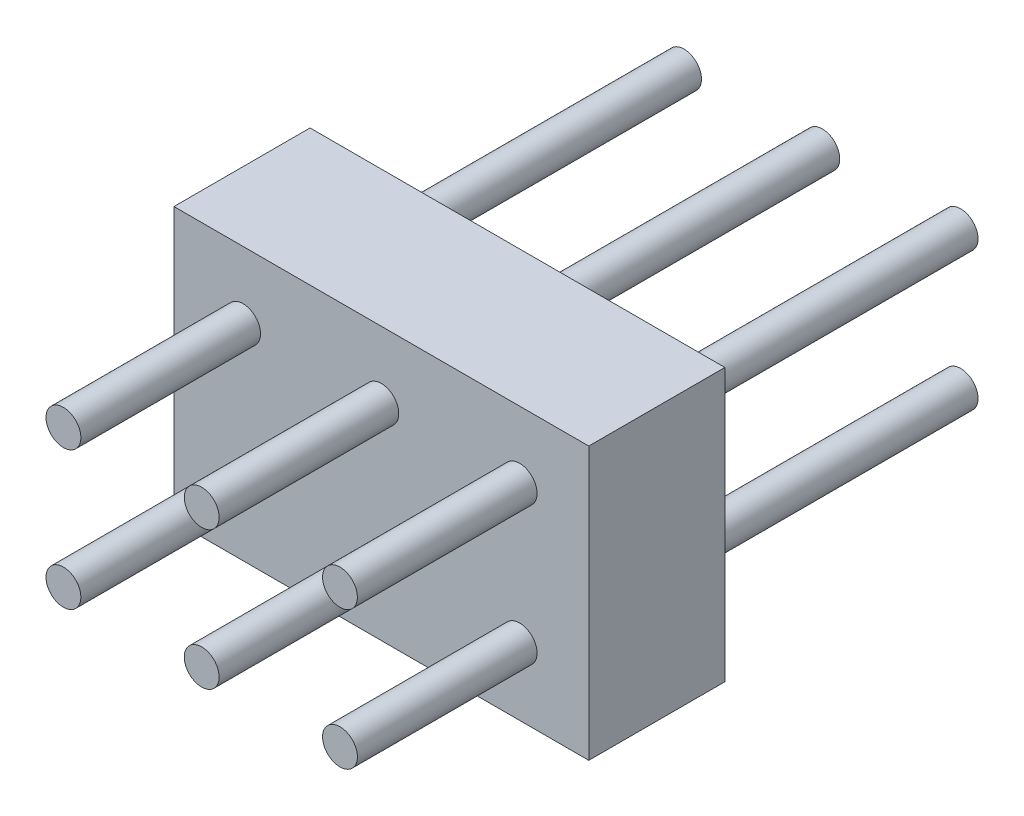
ISO-10303-21;
HEADER;
FILE_DESCRIPTION(('STEP AP214'),'2;1');
FILE_NAME('part.step','',(''),(''),'','','');
FILE_SCHEMA(('AUTOMOTIVE_DESIGN { 1 0 10303 214 1 1 1 1 }'));
ENDSEC;
DATA;
#1=APPLICATION_CONTEXT('core data for automotive mechanical design processes');
#2=APPLICATION_PROTOCOL_DEFINITION('international standard','automotive_design',2000,#1);
#3=PRODUCT_CONTEXT('',#1,'mechanical');
#4=PRODUCT('Part','Part','',(#3));
#5=PRODUCT_RELATED_PRODUCT_CATEGORY('part','',(#4));
#6=PRODUCT_DEFINITION_FORMATION('','',#4);
#7=PRODUCT_DEFINITION_CONTEXT('part definition',#1,'design');
#8=PRODUCT_DEFINITION('design','',#6,#7);
#9=PRODUCT_DEFINITION_SHAPE('','',#8);
#10=(LENGTH_UNIT() NAMED_UNIT(*) SI_UNIT(.MILLI.,.METRE.));
#11=(NAMED_UNIT(*) PLANE_ANGLE_UNIT() SI_UNIT($,.RADIAN.));
#12=(NAMED_UNIT(*) SI_UNIT($,.STERADIAN.) SOLID_ANGLE_UNIT());
#13=UNCERTAINTY_MEASURE_WITH_UNIT(LENGTH_MEASURE(1.E-05),#10,'distance_accuracy_value','');
#14=(GEOMETRIC_REPRESENTATION_CONTEXT(3) GLOBAL_UNCERTAINTY_ASSIGNED_CONTEXT((#13)) GLOBAL_UNIT_ASSIGNED_CONTEXT((#10,
#11,#12)) REPRESENTATION_CONTEXT('',''));
#15=CARTESIAN_POINT('',(0.,0.,0.));
#16=DIRECTION('',(0.,0.,1.));
#17=DIRECTION('',(1.,0.,0.));
#18=AXIS2_PLACEMENT_3D('',#15,#16,#17);
#19=CARTESIAN_POINT('',(0.,0.,2.5));
#20=DIRECTION('',(1.,0.,0.));
#21=DIRECTION('',(0.,0.,-1.));
#22=AXIS2_PLACEMENT_3D('',#19,#20,#21);
#23=PLANE('',#22);
#24=DIRECTION('',(0.,-1.,0.));
#25=VECTOR('',#24,1.);
#26=CARTESIAN_POINT('',(0.,0.,0.));
#27=LINE('',#26,#25);
#28=CARTESIAN_POINT('',(0.,5.,0.));
#29=VERTEX_POINT('',#28);
#30=CARTESIAN_POINT('',(0.,0.,0.));
#31=VERTEX_POINT('',#30);
#32=EDGE_CURVE('E102',#29,#31,#27,.T.);
#33=ORIENTED_EDGE('',*,*,#32,.T.);
#34=DIRECTION('',(0.,0.,-1.));
#35=VECTOR('',#34,1.);
#36=CARTESIAN_POINT('',(0.,0.,2.5));
#37=LINE('',#36,#35);
#38=CARTESIAN_POINT('',(0.,0.,2.5));
#39=VERTEX_POINT('',#38);
#40=EDGE_CURVE('E93',#39,#31,#37,.T.);
#41=ORIENTED_EDGE('',*,*,#40,.F.);
#42=DIRECTION('',(0.,-1.,0.));
#43=VECTOR('',#42,1.);
#44=CARTESIAN_POINT('',(0.,0.,2.5));
#45=LINE('',#44,#43);
#46=CARTESIAN_POINT('',(0.,5.,2.5));
#47=VERTEX_POINT('',#46);
#48=EDGE_CURVE('E87',#47,#39,#45,.T.);
#49=ORIENTED_EDGE('',*,*,#48,.F.);
#50=DIRECTION('',(0.,0.,-1.));
#51=VECTOR('',#50,1.);
#52=CARTESIAN_POINT('',(0.,5.,2.5));
#53=LINE('',#52,#51);
#54=EDGE_CURVE('E98',#47,#29,#53,.T.);
#55=ORIENTED_EDGE('',*,*,#54,.T.);
#56=EDGE_LOOP('',(#33,#41,#49,#55));
#57=FACE_BOUND('',#56,.T.);
#58=ADVANCED_FACE('F35',(#57),#23,.F.);
#59=CARTESIAN_POINT('',(0.,0.,2.5));
#60=DIRECTION('',(0.,1.,0.));
#61=DIRECTION('',(0.,0.,1.));
#62=AXIS2_PLACEMENT_3D('',#59,#60,#61);
#63=PLANE('',#62);
#64=DIRECTION('',(1.,0.,0.));
#65=VECTOR('',#64,1.);
#66=CARTESIAN_POINT('',(0.,0.,0.));
#67=LINE('',#66,#65);
#68=CARTESIAN_POINT('',(7.62,0.,0.));
#69=VERTEX_POINT('',#68);
#70=EDGE_CURVE('E92',#31,#69,#67,.T.);
#71=ORIENTED_EDGE('',*,*,#70,.T.);
#72=DIRECTION('',(0.,0.,-1.));
#73=VECTOR('',#72,1.);
#74=CARTESIAN_POINT('',(7.62,0.,2.5));
#75=LINE('',#74,#73);
#76=CARTESIAN_POINT('',(7.62,0.,2.5));
#77=VERTEX_POINT('',#76);
#78=EDGE_CURVE('E90',#77,#69,#75,.T.);
#79=ORIENTED_EDGE('',*,*,#78,.F.);
#80=DIRECTION('',(1.,0.,0.));
#81=VECTOR('',#80,1.);
#82=CARTESIAN_POINT('',(0.,0.,2.5));
#83=LINE('',#82,#81);
#84=EDGE_CURVE('E82',#39,#77,#83,.T.);
#85=ORIENTED_EDGE('',*,*,#84,.F.);
#86=ORIENTED_EDGE('',*,*,#40,.T.);
#87=EDGE_LOOP('',(#71,#79,#85,#86));
#88=FACE_BOUND('',#87,.T.);
#89=ADVANCED_FACE('F91',(#88),#63,.F.);
#90=CARTESIAN_POINT('',(7.62,0.,2.5));
#91=DIRECTION('',(-1.,0.,0.));
#92=DIRECTION('',(0.,0.,1.));
#93=AXIS2_PLACEMENT_3D('',#90,#91,#92);
#94=PLANE('',#93);
#95=DIRECTION('',(0.,1.,0.));
#96=VECTOR('',#95,1.);
#97=CARTESIAN_POINT('',(7.62,0.,0.));
#98=LINE('',#97,#96);
#99=CARTESIAN_POINT('',(7.62,5.,0.));
#100=VERTEX_POINT('',#99);
#101=EDGE_CURVE('E68',#69,#100,#98,.T.);
#102=ORIENTED_EDGE('',*,*,#101,.T.);
#103=DIRECTION('',(0.,0.,-1.));
#104=VECTOR('',#103,1.);
#105=CARTESIAN_POINT('',(7.62,5.,2.5));
#106=LINE('',#105,#104);
#107=CARTESIAN_POINT('',(7.62,5.,2.5));
#108=VERTEX_POINT('',#107);
#109=EDGE_CURVE('E94',#108,#100,#106,.T.);
#110=ORIENTED_EDGE('',*,*,#109,.F.);
#111=DIRECTION('',(0.,1.,0.));
#112=VECTOR('',#111,1.);
#113=CARTESIAN_POINT('',(7.62,0.,2.5));
#114=LINE('',#113,#112);
#115=EDGE_CURVE('E85',#77,#108,#114,.T.);
#116=ORIENTED_EDGE('',*,*,#115,.F.);
#117=ORIENTED_EDGE('',*,*,#78,.T.);
#118=EDGE_LOOP('',(#102,#110,#116,#117));
#119=FACE_BOUND('',#118,.T.);
#120=ADVANCED_FACE('F96',(#119),#94,.F.);
#121=CARTESIAN_POINT('',(0.,5.,2.5));
#122=DIRECTION('',(0.,-1.,0.));
#123=DIRECTION('',(0.,0.,-1.));
#124=AXIS2_PLACEMENT_3D('',#121,#122,#123);
#125=PLANE('',#124);
#126=DIRECTION('',(-1.,0.,0.));
#127=VECTOR('',#126,1.);
#128=CARTESIAN_POINT('',(0.,5.,0.));
#129=LINE('',#128,#127);
#130=EDGE_CURVE('E74',#100,#29,#129,.T.);
#131=ORIENTED_EDGE('',*,*,#130,.T.);
#132=ORIENTED_EDGE('',*,*,#54,.F.);
#133=DIRECTION('',(-1.,0.,0.));
#134=VECTOR('',#133,1.);
#135=CARTESIAN_POINT('',(0.,5.,2.5));
#136=LINE('',#135,#134);
#137=EDGE_CURVE('E51',#108,#47,#136,.T.);
#138=ORIENTED_EDGE('',*,*,#137,.F.);
#139=ORIENTED_EDGE('',*,*,#109,.T.);
#140=EDGE_LOOP('',(#131,#132,#138,#139));
#141=FACE_BOUND('',#140,.T.);
#142=ADVANCED_FACE('F122',(#141),#125,.F.);
#143=CARTESIAN_POINT('',(0.,0.,2.5));
#144=DIRECTION('',(0.,0.,-1.));
#145=DIRECTION('',(-1.,0.,0.));
#146=AXIS2_PLACEMENT_3D('',#143,#144,#145);
#147=PLANE('',#146);
#148=CARTESIAN_POINT('',(3.81,3.77,2.5));
#149=DIRECTION('',(0.,0.,-1.));
#150=DIRECTION('',(-1.,0.,0.));
#151=AXIS2_PLACEMENT_3D('',#148,#149,#150);
#152=CIRCLE('',#151,0.32);
#153=CARTESIAN_POINT('',(3.49,3.77,2.5));
#154=VERTEX_POINT('',#153);
#155=EDGE_CURVE('E452',#154,#154,#152,.T.);
#156=ORIENTED_EDGE('',*,*,#155,.T.);
#157=EDGE_LOOP('',(#156));
#158=FACE_BOUND('',#157,.T.);
#159=CARTESIAN_POINT('',(6.35,3.77,2.5));
#160=DIRECTION('',(0.,0.,-1.));
#161=DIRECTION('',(-1.,0.,0.));
#162=AXIS2_PLACEMENT_3D('',#159,#160,#161);
#163=CIRCLE('',#162,0.32);
#164=CARTESIAN_POINT('',(6.03,3.77,2.5));
#165=VERTEX_POINT('',#164);
#166=EDGE_CURVE('E458',#165,#165,#163,.T.);
#167=ORIENTED_EDGE('',*,*,#166,.T.);
#168=EDGE_LOOP('',(#167));
#169=FACE_BOUND('',#168,.T.);
#170=CARTESIAN_POINT('',(6.35,1.23,2.5));
#171=DIRECTION('',(0.,0.,-1.));
#172=DIRECTION('',(-1.,0.,0.));
#173=AXIS2_PLACEMENT_3D('',#170,#171,#172);
#174=CIRCLE('',#173,0.32);
#175=CARTESIAN_POINT('',(6.03,1.23,2.5));
#176=VERTEX_POINT('',#175);
#177=EDGE_CURVE('E11',#176,#176,#174,.F.);
#178=ORIENTED_EDGE('',*,*,#177,.F.);
#179=EDGE_LOOP('',(#178));
#180=FACE_BOUND('',#179,.T.);
#181=CARTESIAN_POINT('',(1.27,3.77,2.5));
#182=DIRECTION('',(0.,0.,-1.));
#183=DIRECTION('',(-1.,0.,0.));
#184=AXIS2_PLACEMENT_3D('',#181,#182,#183);
#185=CIRCLE('',#184,0.32);
#186=CARTESIAN_POINT('',(0.950000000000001,3.77,2.5));
#187=VERTEX_POINT('',#186);
#188=EDGE_CURVE('E467',#187,#187,#185,.T.);
#189=ORIENTED_EDGE('',*,*,#188,.T.);
#190=EDGE_LOOP('',(#189));
#191=FACE_BOUND('',#190,.T.);
#192=CARTESIAN_POINT('',(3.81,1.23,2.5));
#193=DIRECTION('',(0.,0.,-1.));
#194=DIRECTION('',(-1.,0.,0.));
#195=AXIS2_PLACEMENT_3D('',#192,#193,#194);
#196=CIRCLE('',#195,0.32);
#197=CARTESIAN_POINT('',(3.49,1.23,2.5));
#198=VERTEX_POINT('',#197);
#199=EDGE_CURVE('E43',#198,#198,#196,.F.);
#200=ORIENTED_EDGE('',*,*,#199,.F.);
#201=EDGE_LOOP('',(#200));
#202=FACE_BOUND('',#201,.T.);
#203=CARTESIAN_POINT('',(1.27,1.23,2.5));
#204=DIRECTION('',(0.,0.,-1.));
#205=DIRECTION('',(-1.,0.,0.));
#206=AXIS2_PLACEMENT_3D('',#203,#204,#205);
#207=CIRCLE('',#206,0.32);
#208=CARTESIAN_POINT('',(0.950000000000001,1.23,2.5));
#209=VERTEX_POINT('',#208);
#210=EDGE_CURVE('E112',#209,#209,#207,.F.);
#211=ORIENTED_EDGE('',*,*,#210,.F.);
#212=EDGE_LOOP('',(#211));
#213=FACE_BOUND('',#212,.T.);
#214=ORIENTED_EDGE('',*,*,#48,.T.);
#215=ORIENTED_EDGE('',*,*,#84,.T.);
#216=ORIENTED_EDGE('',*,*,#115,.T.);
#217=ORIENTED_EDGE('',*,*,#137,.T.);
#218=EDGE_LOOP('',(#214,#215,#216,#217));
#219=FACE_BOUND('',#218,.T.);
#220=ADVANCED_FACE('F83',(#158,#169,#180,#191,#202,#213,#219),#147,.F.);
#221=CARTESIAN_POINT('',(0.,0.,0.));
#222=DIRECTION('',(0.,0.,-1.));
#223=DIRECTION('',(-1.,0.,0.));
#224=AXIS2_PLACEMENT_3D('',#221,#222,#223);
#225=PLANE('',#224);
#226=CARTESIAN_POINT('',(6.35,3.77,0.));
#227=DIRECTION('',(0.,0.,-1.));
#228=DIRECTION('',(-1.,0.,0.));
#229=AXIS2_PLACEMENT_3D('',#226,#227,#228);
#230=CIRCLE('',#229,0.32);
#231=CARTESIAN_POINT('',(6.03,3.77,0.));
#232=VERTEX_POINT('',#231);
#233=EDGE_CURVE('E417',#232,#232,#230,.T.);
#234=ORIENTED_EDGE('',*,*,#233,.F.);
#235=EDGE_LOOP('',(#234));
#236=FACE_BOUND('',#235,.T.);
#237=CARTESIAN_POINT('',(6.35,1.23,0.));
#238=DIRECTION('',(0.,0.,-1.));
#239=DIRECTION('',(-1.,0.,0.));
#240=AXIS2_PLACEMENT_3D('',#237,#238,#239);
#241=CIRCLE('',#240,0.32);
#242=CARTESIAN_POINT('',(6.03,1.23,0.));
#243=VERTEX_POINT('',#242);
#244=EDGE_CURVE('E416',#243,#243,#241,.T.);
#245=ORIENTED_EDGE('',*,*,#244,.F.);
#246=EDGE_LOOP('',(#245));
#247=FACE_BOUND('',#246,.T.);
#248=CARTESIAN_POINT('',(3.81,3.77,0.));
#249=DIRECTION('',(0.,0.,-1.));
#250=DIRECTION('',(-1.,0.,0.));
#251=AXIS2_PLACEMENT_3D('',#248,#249,#250);
#252=CIRCLE('',#251,0.32);
#253=CARTESIAN_POINT('',(3.49,3.77,0.));
#254=VERTEX_POINT('',#253);
#255=EDGE_CURVE('E426',#254,#254,#252,.T.);
#256=ORIENTED_EDGE('',*,*,#255,.F.);
#257=EDGE_LOOP('',(#256));
#258=FACE_BOUND('',#257,.T.);
#259=CARTESIAN_POINT('',(3.81,1.23,0.));
#260=DIRECTION('',(0.,0.,-1.));
#261=DIRECTION('',(-1.,0.,0.));
#262=AXIS2_PLACEMENT_3D('',#259,#260,#261);
#263=CIRCLE('',#262,0.32);
#264=CARTESIAN_POINT('',(3.49,1.23,0.));
#265=VERTEX_POINT('',#264);
#266=EDGE_CURVE('E431',#265,#265,#263,.T.);
#267=ORIENTED_EDGE('',*,*,#266,.F.);
#268=EDGE_LOOP('',(#267));
#269=FACE_BOUND('',#268,.T.);
#270=CARTESIAN_POINT('',(1.27,3.77,0.));
#271=DIRECTION('',(0.,0.,-1.));
#272=DIRECTION('',(-1.,0.,0.));
#273=AXIS2_PLACEMENT_3D('',#270,#271,#272);
#274=CIRCLE('',#273,0.32);
#275=CARTESIAN_POINT('',(0.950000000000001,3.77,0.));
#276=VERTEX_POINT('',#275);
#277=EDGE_CURVE('E437',#276,#276,#274,.T.);
#278=ORIENTED_EDGE('',*,*,#277,.F.);
#279=EDGE_LOOP('',(#278));
#280=FACE_BOUND('',#279,.T.);
#281=CARTESIAN_POINT('',(1.27,1.23,0.));
#282=DIRECTION('',(0.,0.,-1.));
#283=DIRECTION('',(-1.,0.,0.));
#284=AXIS2_PLACEMENT_3D('',#281,#282,#283);
#285=CIRCLE('',#284,0.32);
#286=CARTESIAN_POINT('',(0.950000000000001,1.23,0.));
#287=VERTEX_POINT('',#286);
#288=EDGE_CURVE('E443',#287,#287,#285,.T.);
#289=ORIENTED_EDGE('',*,*,#288,.F.);
#290=EDGE_LOOP('',(#289));
#291=FACE_BOUND('',#290,.T.);
#292=ORIENTED_EDGE('',*,*,#32,.F.);
#293=ORIENTED_EDGE('',*,*,#130,.F.);
#294=ORIENTED_EDGE('',*,*,#101,.F.);
#295=ORIENTED_EDGE('',*,*,#70,.F.);
#296=EDGE_LOOP('',(#292,#293,#294,#295));
#297=FACE_BOUND('',#296,.T.);
#298=ADVANCED_FACE('F121',(#236,#247,#258,#269,#280,#291,#297),#225,.T.);
#299=CARTESIAN_POINT('',(1.27,1.23,5.8));
#300=DIRECTION('',(0.,0.,-1.));
#301=DIRECTION('',(-1.,0.,0.));
#302=AXIS2_PLACEMENT_3D('',#299,#300,#301);
#303=CYLINDRICAL_SURFACE('',#302,0.32);
#304=CARTESIAN_POINT('',(1.27,1.23,5.8));
#305=DIRECTION('',(0.,0.,1.));
#306=DIRECTION('',(1.,0.,0.));
#307=AXIS2_PLACEMENT_3D('',#304,#305,#306);
#308=CIRCLE('',#307,0.32);
#309=CARTESIAN_POINT('',(1.59,1.23,5.8));
#310=VERTEX_POINT('',#309);
#311=EDGE_CURVE('E105',#310,#310,#308,.T.);
#312=ORIENTED_EDGE('',*,*,#311,.F.);
#313=EDGE_LOOP('',(#312));
#314=FACE_BOUND('',#313,.T.);
#315=ORIENTED_EDGE('',*,*,#210,.T.);
#316=EDGE_LOOP('',(#315));
#317=FACE_BOUND('',#316,.T.);
#318=ADVANCED_FACE('F127',(#314,#317),#303,.T.);
#319=CARTESIAN_POINT('',(1.27,1.23,5.8));
#320=DIRECTION('',(0.,0.,1.));
#321=DIRECTION('',(1.,0.,0.));
#322=AXIS2_PLACEMENT_3D('',#319,#320,#321);
#323=PLANE('',#322);
#324=ORIENTED_EDGE('',*,*,#311,.T.);
#325=EDGE_LOOP('',(#324));
#326=FACE_BOUND('',#325,.T.);
#327=ADVANCED_FACE('F129',(#326),#323,.T.);
#328=CARTESIAN_POINT('',(3.81,1.23,5.8));
#329=DIRECTION('',(0.,0.,-1.));
#330=DIRECTION('',(-1.,0.,0.));
#331=AXIS2_PLACEMENT_3D('',#328,#329,#330);
#332=CYLINDRICAL_SURFACE('',#331,0.32);
#333=CARTESIAN_POINT('',(3.81,1.23,5.8));
#334=DIRECTION('',(0.,0.,1.));
#335=DIRECTION('',(1.,0.,0.));
#336=AXIS2_PLACEMENT_3D('',#333,#334,#335);
#337=CIRCLE('',#336,0.32);
#338=CARTESIAN_POINT('',(4.13,1.23,5.8));
#339=VERTEX_POINT('',#338);
#340=EDGE_CURVE('E470',#339,#339,#337,.T.);
#341=ORIENTED_EDGE('',*,*,#340,.F.);
#342=EDGE_LOOP('',(#341));
#343=FACE_BOUND('',#342,.T.);
#344=ORIENTED_EDGE('',*,*,#199,.T.);
#345=EDGE_LOOP('',(#344));
#346=FACE_BOUND('',#345,.T.);
#347=ADVANCED_FACE('F117',(#343,#346),#332,.T.);
#348=CARTESIAN_POINT('',(3.81,1.23,5.8));
#349=DIRECTION('',(0.,0.,1.));
#350=DIRECTION('',(1.,0.,0.));
#351=AXIS2_PLACEMENT_3D('',#348,#349,#350);
#352=PLANE('',#351);
#353=ORIENTED_EDGE('',*,*,#340,.T.);
#354=EDGE_LOOP('',(#353));
#355=FACE_BOUND('',#354,.T.);
#356=ADVANCED_FACE('F201',(#355),#352,.T.);
#357=CARTESIAN_POINT('',(1.27,3.77,5.8));
#358=DIRECTION('',(0.,0.,-1.));
#359=DIRECTION('',(-1.,0.,0.));
#360=AXIS2_PLACEMENT_3D('',#357,#358,#359);
#361=CYLINDRICAL_SURFACE('',#360,0.32);
#362=CARTESIAN_POINT('',(1.27,3.77,5.8));
#363=DIRECTION('',(0.,0.,-1.));
#364=DIRECTION('',(-1.,0.,0.));
#365=AXIS2_PLACEMENT_3D('',#362,#363,#364);
#366=CIRCLE('',#365,0.32);
#367=CARTESIAN_POINT('',(0.950000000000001,3.77,5.8));
#368=VERTEX_POINT('',#367);
#369=EDGE_CURVE('E466',#368,#368,#366,.T.);
#370=ORIENTED_EDGE('',*,*,#369,.T.);
#371=EDGE_LOOP('',(#370));
#372=FACE_BOUND('',#371,.T.);
#373=ORIENTED_EDGE('',*,*,#188,.F.);
#374=EDGE_LOOP('',(#373));
#375=FACE_BOUND('',#374,.T.);
#376=ADVANCED_FACE('F210',(#372,#375),#361,.T.);
#377=CARTESIAN_POINT('',(1.27,3.77,5.8));
#378=DIRECTION('',(0.,0.,-1.));
#379=DIRECTION('',(-1.,0.,0.));
#380=AXIS2_PLACEMENT_3D('',#377,#378,#379);
#381=PLANE('',#380);
#382=ORIENTED_EDGE('',*,*,#369,.F.);
#383=EDGE_LOOP('',(#382));
#384=FACE_BOUND('',#383,.T.);
#385=ADVANCED_FACE('F219',(#384),#381,.F.);
#386=CARTESIAN_POINT('',(6.35,1.23,5.8));
#387=DIRECTION('',(0.,0.,-1.));
#388=DIRECTION('',(-1.,0.,0.));
#389=AXIS2_PLACEMENT_3D('',#386,#387,#388);
#390=CYLINDRICAL_SURFACE('',#389,0.32);
#391=CARTESIAN_POINT('',(6.35,1.23,5.8));
#392=DIRECTION('',(0.,0.,1.));
#393=DIRECTION('',(1.,0.,0.));
#394=AXIS2_PLACEMENT_3D('',#391,#392,#393);
#395=CIRCLE('',#394,0.32);
#396=CARTESIAN_POINT('',(6.67,1.23,5.8));
#397=VERTEX_POINT('',#396);
#398=EDGE_CURVE('E461',#397,#397,#395,.T.);
#399=ORIENTED_EDGE('',*,*,#398,.F.);
#400=EDGE_LOOP('',(#399));
#401=FACE_BOUND('',#400,.T.);
#402=ORIENTED_EDGE('',*,*,#177,.T.);
#403=EDGE_LOOP('',(#402));
#404=FACE_BOUND('',#403,.T.);
#405=ADVANCED_FACE('F228',(#401,#404),#390,.T.);
#406=CARTESIAN_POINT('',(6.35,1.23,5.8));
#407=DIRECTION('',(0.,0.,1.));
#408=DIRECTION('',(1.,0.,0.));
#409=AXIS2_PLACEMENT_3D('',#406,#407,#408);
#410=PLANE('',#409);
#411=ORIENTED_EDGE('',*,*,#398,.T.);
#412=EDGE_LOOP('',(#411));
#413=FACE_BOUND('',#412,.T.);
#414=ADVANCED_FACE('F237',(#413),#410,.T.);
#415=CARTESIAN_POINT('',(6.35,3.77,5.8));
#416=DIRECTION('',(0.,0.,-1.));
#417=DIRECTION('',(-1.,0.,0.));
#418=AXIS2_PLACEMENT_3D('',#415,#416,#417);
#419=CYLINDRICAL_SURFACE('',#418,0.32);
#420=CARTESIAN_POINT('',(6.35,3.77,5.8));
#421=DIRECTION('',(0.,0.,-1.));
#422=DIRECTION('',(-1.,0.,0.));
#423=AXIS2_PLACEMENT_3D('',#420,#421,#422);
#424=CIRCLE('',#423,0.32);
#425=CARTESIAN_POINT('',(6.03,3.77,5.8));
#426=VERTEX_POINT('',#425);
#427=EDGE_CURVE('E455',#426,#426,#424,.T.);
#428=ORIENTED_EDGE('',*,*,#427,.T.);
#429=EDGE_LOOP('',(#428));
#430=FACE_BOUND('',#429,.T.);
#431=ORIENTED_EDGE('',*,*,#166,.F.);
#432=EDGE_LOOP('',(#431));
#433=FACE_BOUND('',#432,.T.);
#434=ADVANCED_FACE('F246',(#430,#433),#419,.T.);
#435=CARTESIAN_POINT('',(6.35,3.77,5.8));
#436=DIRECTION('',(0.,0.,-1.));
#437=DIRECTION('',(-1.,0.,0.));
#438=AXIS2_PLACEMENT_3D('',#435,#436,#437);
#439=PLANE('',#438);
#440=ORIENTED_EDGE('',*,*,#427,.F.);
#441=EDGE_LOOP('',(#440));
#442=FACE_BOUND('',#441,.T.);
#443=ADVANCED_FACE('F255',(#442),#439,.F.);
#444=CARTESIAN_POINT('',(3.81,3.77,5.8));
#445=DIRECTION('',(0.,0.,-1.));
#446=DIRECTION('',(-1.,0.,0.));
#447=AXIS2_PLACEMENT_3D('',#444,#445,#446);
#448=CYLINDRICAL_SURFACE('',#447,0.32);
#449=CARTESIAN_POINT('',(3.81,3.77,5.8));
#450=DIRECTION('',(0.,0.,-1.));
#451=DIRECTION('',(-1.,0.,0.));
#452=AXIS2_PLACEMENT_3D('',#449,#450,#451);
#453=CIRCLE('',#452,0.32);
#454=CARTESIAN_POINT('',(3.49,3.77,5.8));
#455=VERTEX_POINT('',#454);
#456=EDGE_CURVE('E449',#455,#455,#453,.T.);
#457=ORIENTED_EDGE('',*,*,#456,.T.);
#458=EDGE_LOOP('',(#457));
#459=FACE_BOUND('',#458,.T.);
#460=ORIENTED_EDGE('',*,*,#155,.F.);
#461=EDGE_LOOP('',(#460));
#462=FACE_BOUND('',#461,.T.);
#463=ADVANCED_FACE('F264',(#459,#462),#448,.T.);
#464=CARTESIAN_POINT('',(3.81,3.77,5.8));
#465=DIRECTION('',(0.,0.,-1.));
#466=DIRECTION('',(-1.,0.,0.));
#467=AXIS2_PLACEMENT_3D('',#464,#465,#466);
#468=PLANE('',#467);
#469=ORIENTED_EDGE('',*,*,#456,.F.);
#470=EDGE_LOOP('',(#469));
#471=FACE_BOUND('',#470,.T.);
#472=ADVANCED_FACE('F273',(#471),#468,.F.);
#473=CARTESIAN_POINT('',(1.27,1.23,-5.6));
#474=DIRECTION('',(0.,0.,1.));
#475=DIRECTION('',(1.,0.,0.));
#476=AXIS2_PLACEMENT_3D('',#473,#474,#475);
#477=CYLINDRICAL_SURFACE('',#476,0.32);
#478=CARTESIAN_POINT('',(1.27,1.23,-5.6));
#479=DIRECTION('',(0.,0.,-1.));
#480=DIRECTION('',(-1.,0.,0.));
#481=AXIS2_PLACEMENT_3D('',#478,#479,#480);
#482=CIRCLE('',#481,0.32);
#483=CARTESIAN_POINT('',(0.950000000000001,1.23,-5.6));
#484=VERTEX_POINT('',#483);
#485=EDGE_CURVE('E446',#484,#484,#482,.T.);
#486=ORIENTED_EDGE('',*,*,#485,.F.);
#487=EDGE_LOOP('',(#486));
#488=FACE_BOUND('',#487,.T.);
#489=ORIENTED_EDGE('',*,*,#288,.T.);
#490=EDGE_LOOP('',(#489));
#491=FACE_BOUND('',#490,.T.);
#492=ADVANCED_FACE('F281',(#488,#491),#477,.T.);
#493=CARTESIAN_POINT('',(1.27,1.23,-5.6));
#494=DIRECTION('',(0.,0.,-1.));
#495=DIRECTION('',(-1.,0.,0.));
#496=AXIS2_PLACEMENT_3D('',#493,#494,#495);
#497=PLANE('',#496);
#498=ORIENTED_EDGE('',*,*,#485,.T.);
#499=EDGE_LOOP('',(#498));
#500=FACE_BOUND('',#499,.T.);
#501=ADVANCED_FACE('F289',(#500),#497,.T.);
#502=CARTESIAN_POINT('',(1.27,3.77,-5.6));
#503=DIRECTION('',(0.,0.,1.));
#504=DIRECTION('',(1.,0.,0.));
#505=AXIS2_PLACEMENT_3D('',#502,#503,#504);
#506=CYLINDRICAL_SURFACE('',#505,0.32);
#507=CARTESIAN_POINT('',(1.27,3.77,-5.6));
#508=DIRECTION('',(0.,0.,-1.));
#509=DIRECTION('',(-1.,0.,0.));
#510=AXIS2_PLACEMENT_3D('',#507,#508,#509);
#511=CIRCLE('',#510,0.32);
#512=CARTESIAN_POINT('',(0.950000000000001,3.77,-5.6));
#513=VERTEX_POINT('',#512);
#514=EDGE_CURVE('E440',#513,#513,#511,.T.);
#515=ORIENTED_EDGE('',*,*,#514,.F.);
#516=EDGE_LOOP('',(#515));
#517=FACE_BOUND('',#516,.T.);
#518=ORIENTED_EDGE('',*,*,#277,.T.);
#519=EDGE_LOOP('',(#518));
#520=FACE_BOUND('',#519,.T.);
#521=ADVANCED_FACE('F298',(#517,#520),#506,.T.);
#522=CARTESIAN_POINT('',(1.27,3.77,-5.6));
#523=DIRECTION('',(0.,0.,-1.));
#524=DIRECTION('',(-1.,0.,0.));
#525=AXIS2_PLACEMENT_3D('',#522,#523,#524);
#526=PLANE('',#525);
#527=ORIENTED_EDGE('',*,*,#514,.T.);
#528=EDGE_LOOP('',(#527));
#529=FACE_BOUND('',#528,.T.);
#530=ADVANCED_FACE('F307',(#529),#526,.T.);
#531=CARTESIAN_POINT('',(3.81,1.23,-5.6));
#532=DIRECTION('',(0.,0.,1.));
#533=DIRECTION('',(1.,0.,0.));
#534=AXIS2_PLACEMENT_3D('',#531,#532,#533);
#535=CYLINDRICAL_SURFACE('',#534,0.32);
#536=CARTESIAN_POINT('',(3.81,1.23,-5.6));
#537=DIRECTION('',(0.,0.,-1.));
#538=DIRECTION('',(-1.,0.,0.));
#539=AXIS2_PLACEMENT_3D('',#536,#537,#538);
#540=CIRCLE('',#539,0.32);
#541=CARTESIAN_POINT('',(3.49,1.23,-5.6));
#542=VERTEX_POINT('',#541);
#543=EDGE_CURVE('E434',#542,#542,#540,.T.);
#544=ORIENTED_EDGE('',*,*,#543,.F.);
#545=EDGE_LOOP('',(#544));
#546=FACE_BOUND('',#545,.T.);
#547=ORIENTED_EDGE('',*,*,#266,.T.);
#548=EDGE_LOOP('',(#547));
#549=FACE_BOUND('',#548,.T.);
#550=ADVANCED_FACE('F316',(#546,#549),#535,.T.);
#551=CARTESIAN_POINT('',(3.81,1.23,-5.6));
#552=DIRECTION('',(0.,0.,-1.));
#553=DIRECTION('',(-1.,0.,0.));
#554=AXIS2_PLACEMENT_3D('',#551,#552,#553);
#555=PLANE('',#554);
#556=ORIENTED_EDGE('',*,*,#543,.T.);
#557=EDGE_LOOP('',(#556));
#558=FACE_BOUND('',#557,.T.);
#559=ADVANCED_FACE('F325',(#558),#555,.T.);
#560=CARTESIAN_POINT('',(3.81,3.77,-5.6));
#561=DIRECTION('',(0.,0.,1.));
#562=DIRECTION('',(1.,0.,0.));
#563=AXIS2_PLACEMENT_3D('',#560,#561,#562);
#564=CYLINDRICAL_SURFACE('',#563,0.32);
#565=CARTESIAN_POINT('',(3.81,3.77,-5.6));
#566=DIRECTION('',(0.,0.,-1.));
#567=DIRECTION('',(-1.,0.,0.));
#568=AXIS2_PLACEMENT_3D('',#565,#566,#567);
#569=CIRCLE('',#568,0.32);
#570=CARTESIAN_POINT('',(3.49,3.77,-5.6));
#571=VERTEX_POINT('',#570);
#572=EDGE_CURVE('E428',#571,#571,#569,.T.);
#573=ORIENTED_EDGE('',*,*,#572,.F.);
#574=EDGE_LOOP('',(#573));
#575=FACE_BOUND('',#574,.T.);
#576=ORIENTED_EDGE('',*,*,#255,.T.);
#577=EDGE_LOOP('',(#576));
#578=FACE_BOUND('',#577,.T.);
#579=ADVANCED_FACE('F334',(#575,#578),#564,.T.);
#580=CARTESIAN_POINT('',(3.81,3.77,-5.6));
#581=DIRECTION('',(0.,0.,-1.));
#582=DIRECTION('',(-1.,0.,0.));
#583=AXIS2_PLACEMENT_3D('',#580,#581,#582);
#584=PLANE('',#583);
#585=ORIENTED_EDGE('',*,*,#572,.T.);
#586=EDGE_LOOP('',(#585));
#587=FACE_BOUND('',#586,.T.);
#588=ADVANCED_FACE('F343',(#587),#584,.T.);
#589=CARTESIAN_POINT('',(6.35,1.23,-5.6));
#590=DIRECTION('',(0.,0.,1.));
#591=DIRECTION('',(1.,0.,0.));
#592=AXIS2_PLACEMENT_3D('',#589,#590,#591);
#593=CYLINDRICAL_SURFACE('',#592,0.32);
#594=CARTESIAN_POINT('',(6.35,1.23,-5.6));
#595=DIRECTION('',(0.,0.,-1.));
#596=DIRECTION('',(-1.,0.,0.));
#597=AXIS2_PLACEMENT_3D('',#594,#595,#596);
#598=CIRCLE('',#597,0.32);
#599=CARTESIAN_POINT('',(6.03,1.23,-5.6));
#600=VERTEX_POINT('',#599);
#601=EDGE_CURVE('E420',#600,#600,#598,.T.);
#602=ORIENTED_EDGE('',*,*,#601,.F.);
#603=EDGE_LOOP('',(#602));
#604=FACE_BOUND('',#603,.T.);
#605=ORIENTED_EDGE('',*,*,#244,.T.);
#606=EDGE_LOOP('',(#605));
#607=FACE_BOUND('',#606,.T.);
#608=ADVANCED_FACE('F352',(#604,#607),#593,.T.);
#609=CARTESIAN_POINT('',(6.35,1.23,-5.6));
#610=DIRECTION('',(0.,0.,-1.));
#611=DIRECTION('',(-1.,0.,0.));
#612=AXIS2_PLACEMENT_3D('',#609,#610,#611);
#613=PLANE('',#612);
#614=ORIENTED_EDGE('',*,*,#601,.T.);
#615=EDGE_LOOP('',(#614));
#616=FACE_BOUND('',#615,.T.);
#617=ADVANCED_FACE('F361',(#616),#613,.T.);
#618=CARTESIAN_POINT('',(6.35,3.77,-5.6));
#619=DIRECTION('',(0.,0.,1.));
#620=DIRECTION('',(1.,0.,0.));
#621=AXIS2_PLACEMENT_3D('',#618,#619,#620);
#622=CYLINDRICAL_SURFACE('',#621,0.32);
#623=CARTESIAN_POINT('',(6.35,3.77,-5.6));
#624=DIRECTION('',(0.,0.,-1.));
#625=DIRECTION('',(-1.,0.,0.));
#626=AXIS2_PLACEMENT_3D('',#623,#624,#625);
#627=CIRCLE('',#626,0.32);
#628=CARTESIAN_POINT('',(6.03,3.77,-5.6));
#629=VERTEX_POINT('',#628);
#630=EDGE_CURVE('E415',#629,#629,#627,.T.);
#631=ORIENTED_EDGE('',*,*,#630,.F.);
#632=EDGE_LOOP('',(#631));
#633=FACE_BOUND('',#632,.T.);
#634=ORIENTED_EDGE('',*,*,#233,.T.);
#635=EDGE_LOOP('',(#634));
#636=FACE_BOUND('',#635,.T.);
#637=ADVANCED_FACE('F370',(#633,#636),#622,.T.);
#638=CARTESIAN_POINT('',(6.35,3.77,-5.6));
#639=DIRECTION('',(0.,0.,-1.));
#640=DIRECTION('',(-1.,0.,0.));
#641=AXIS2_PLACEMENT_3D('',#638,#639,#640);
#642=PLANE('',#641);
#643=ORIENTED_EDGE('',*,*,#630,.T.);
#644=EDGE_LOOP('',(#643));
#645=FACE_BOUND('',#644,.T.);
#646=ADVANCED_FACE('F379',(#645),#642,.T.);
#647=CLOSED_SHELL('',(#58,#89,#120,#142,#220,#298,#318,#327,#347,#356,#376,#385,#405,#414,#434,
#443,#463,#472,#492,#501,#521,#530,#550,#559,#579,#588,#608,#617,#637,#646));
#648=MANIFOLD_SOLID_BREP('B2',#647);
#649=ADVANCED_BREP_SHAPE_REPRESENTATION('',(#18,#648),#14);
#650=SHAPE_DEFINITION_REPRESENTATION(#9,#649);
ENDSEC;
END-ISO-10303-21;
